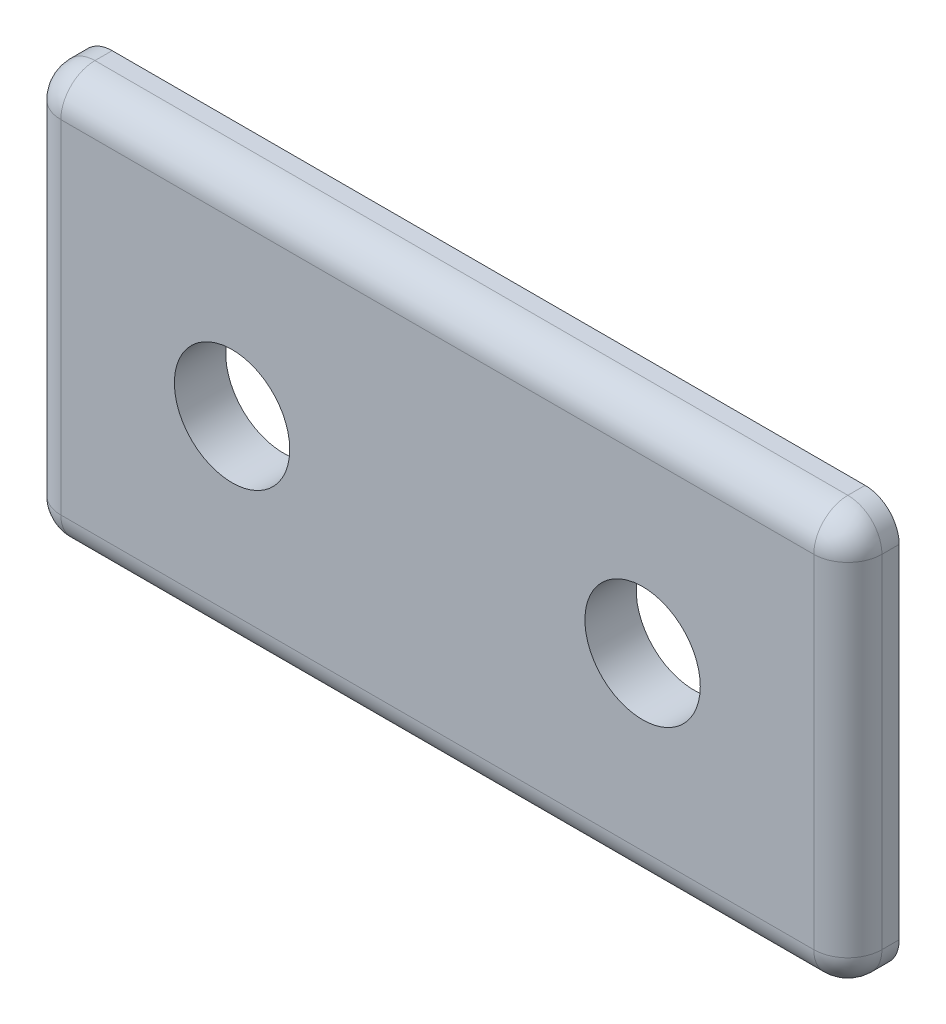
from build123d import *

# Parameters (mm, degrees)
SKETCH1_W           = 50.8
SKETCH1_H           = 25.4
BOSS_EXTRUDE1_DEPTH = 3.175
FILLET1_R           = 2.1082
CUT_EXTRUDE1_REACH  = 30.575
SKETCH2_R           = 3.5687


with BuildPart() as part:
    # Sketch1 → Boss-Extrude1 (new body)
    with BuildSketch(Plane.XY):
        Rectangle(SKETCH1_W, SKETCH1_H)
    extrude(amount=BOSS_EXTRUDE1_DEPTH)

    # Fillet1
    fillet1_edges = [part.edges().sort_by_distance(p)[0] for p in [
        (25.4, 0, 3.175),
        (0, 12.7, 3.175),
        (-25.4, 0, 3.175),
        (0, -12.7, 3.175),
        (-25.4, 12.7, 1.5875),
        (25.4, 12.7, 1.5875),
        (25.4, -12.7, 1.5875),
        (-25.4, -12.7, 1.5875),
    ]]
    fillet(fillet1_edges, radius=FILLET1_R)

    # Sketch2 → Cut-Extrude1 (cut, up to next)
    with BuildSketch(Plane.XY.offset(3.175), mode=Mode.PRIVATE) as cut_extrude1_sk1:
        with Locations((-12.7, 0)):
            Circle(SKETCH2_R)
    cut_extrude1_tool1 = extrude(cut_extrude1_sk1.sketch, amount=-CUT_EXTRUDE1_REACH, mode=Mode.PRIVATE) & part.part
    # Sketch2 → Cut-Extrude1 (cut, up to next)
    with BuildSketch(Plane.XY.offset(3.175), mode=Mode.PRIVATE) as cut_extrude1_sk2:
        with Locations((12.7, 0)):
            Circle(SKETCH2_R)
    cut_extrude1_tool2 = extrude(cut_extrude1_sk2.sketch, amount=-CUT_EXTRUDE1_REACH, mode=Mode.PRIVATE) & part.part
    add(cut_extrude1_tool1.solids().sort_by_distance((-12.7, 0, 3.175))[0], mode=Mode.SUBTRACT)
    add(cut_extrude1_tool2.solids().sort_by_distance((12.7, 0, 3.175))[0], mode=Mode.SUBTRACT)


solid = part.part
